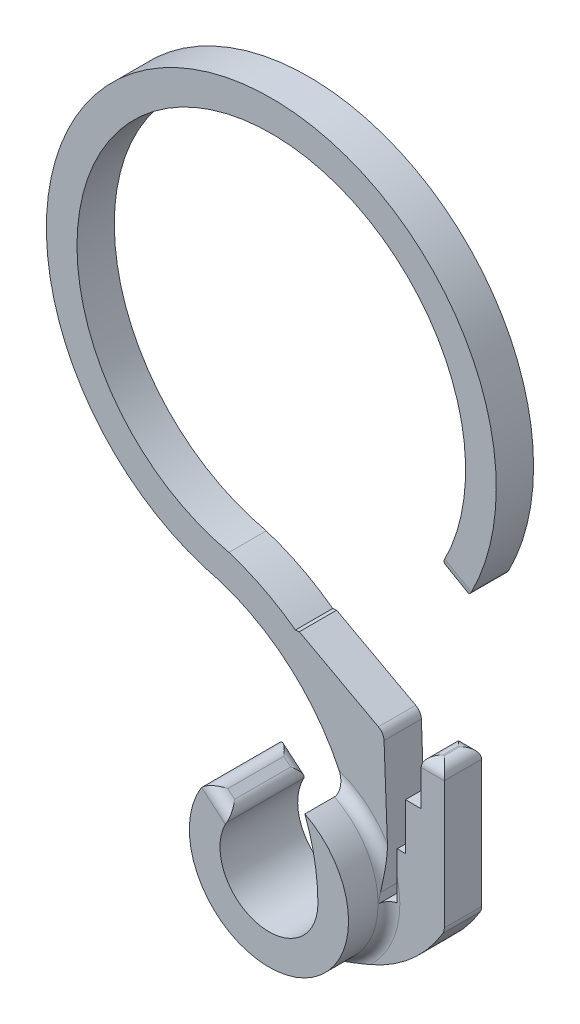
ISO-10303-21;
HEADER;
FILE_DESCRIPTION(('STEP AP214'),'2;1');
FILE_NAME('part.step','',(''),(''),'','','');
FILE_SCHEMA(('AUTOMOTIVE_DESIGN { 1 0 10303 214 1 1 1 1 }'));
ENDSEC;
DATA;
#1=APPLICATION_CONTEXT('core data for automotive mechanical design processes');
#2=APPLICATION_PROTOCOL_DEFINITION('international standard','automotive_design',2000,#1);
#3=PRODUCT_CONTEXT('',#1,'mechanical');
#4=PRODUCT('Part','Part','',(#3));
#5=PRODUCT_RELATED_PRODUCT_CATEGORY('part','',(#4));
#6=PRODUCT_DEFINITION_FORMATION('','',#4);
#7=PRODUCT_DEFINITION_CONTEXT('part definition',#1,'design');
#8=PRODUCT_DEFINITION('design','',#6,#7);
#9=PRODUCT_DEFINITION_SHAPE('','',#8);
#10=(LENGTH_UNIT() NAMED_UNIT(*) SI_UNIT(.MILLI.,.METRE.));
#11=(NAMED_UNIT(*) PLANE_ANGLE_UNIT() SI_UNIT($,.RADIAN.));
#12=(NAMED_UNIT(*) SI_UNIT($,.STERADIAN.) SOLID_ANGLE_UNIT());
#13=UNCERTAINTY_MEASURE_WITH_UNIT(LENGTH_MEASURE(1.E-05),#10,'distance_accuracy_value','');
#14=(GEOMETRIC_REPRESENTATION_CONTEXT(3) GLOBAL_UNCERTAINTY_ASSIGNED_CONTEXT((#13)) GLOBAL_UNIT_ASSIGNED_CONTEXT((#10,
#11,#12)) REPRESENTATION_CONTEXT('',''));
#15=CARTESIAN_POINT('',(0.,0.,0.));
#16=DIRECTION('',(0.,0.,1.));
#17=DIRECTION('',(1.,0.,0.));
#18=AXIS2_PLACEMENT_3D('',#15,#16,#17);
#19=CARTESIAN_POINT('',(0.,0.,3.1));
#20=DIRECTION('',(0.,0.,1.));
#21=DIRECTION('',(1.,0.,0.));
#22=AXIS2_PLACEMENT_3D('',#19,#20,#21);
#23=TOROIDAL_SURFACE('',#22,5.82,0.7);
#24=CARTESIAN_POINT('',(5.82,0.,3.1));
#25=DIRECTION('',(0.,1.,0.));
#26=DIRECTION('',(-1.,0.,0.));
#27=AXIS2_PLACEMENT_3D('',#24,#25,#26);
#28=CIRCLE('',#27,0.7);
#29=CARTESIAN_POINT('',(5.12,0.,3.09999793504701));
#30=VERTEX_POINT('',#29);
#31=CARTESIAN_POINT('',(5.65,0.,2.4209565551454));
#32=VERTEX_POINT('',#31);
#33=EDGE_CURVE('E107',#30,#32,#28,.F.);
#34=ORIENTED_EDGE('',*,*,#33,.F.);
#35=CARTESIAN_POINT('',(0.,0.,3.1));
#36=DIRECTION('',(0.,0.,1.));
#37=DIRECTION('',(1.,0.,0.));
#38=AXIS2_PLACEMENT_3D('',#35,#36,#37);
#39=CIRCLE('',#38,5.12);
#40=CARTESIAN_POINT('',(0.,-5.12,3.1));
#41=VERTEX_POINT('',#40);
#42=EDGE_CURVE('E514',#41,#30,#39,.T.);
#43=ORIENTED_EDGE('',*,*,#42,.F.);
#44=CARTESIAN_POINT('',(3.88248314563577,-4.3357496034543,2.4));
#45=CARTESIAN_POINT('',(3.77393906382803,-4.3814716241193,2.400042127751));
#46=CARTESIAN_POINT('',(3.66462624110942,-4.42524937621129,2.4031480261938));
#47=CARTESIAN_POINT('',(3.44484362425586,-4.508808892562,2.41462716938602));
#48=CARTESIAN_POINT('',(3.33437475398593,-4.54859361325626,2.42299648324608));
#49=CARTESIAN_POINT('',(3.11268098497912,-4.6240656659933,2.4441274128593));
#50=CARTESIAN_POINT('',(3.00145763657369,-4.6597596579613,2.45688175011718));
#51=CARTESIAN_POINT('',(2.77826335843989,-4.72711763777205,2.48614227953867));
#52=CARTESIAN_POINT('',(2.6662922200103,-4.75878044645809,2.50264956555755));
#53=CARTESIAN_POINT('',(2.34495078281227,-4.84364442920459,2.55444875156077));
#54=CARTESIAN_POINT('',(2.13487113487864,-4.89186779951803,2.59366236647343));
#55=CARTESIAN_POINT('',(1.71363145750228,-4.97445557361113,2.67993887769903));
#56=CARTESIAN_POINT('',(1.50247098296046,-5.00881370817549,2.72700531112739));
#57=CARTESIAN_POINT('',(0.868026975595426,-5.09138398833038,2.8758828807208));
#58=CARTESIAN_POINT('',(0.443595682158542,-5.11914035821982,2.98540697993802));
#59=CARTESIAN_POINT('',(0.0132213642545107,-5.1199934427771,3.09658450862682));
#60=CARTESIAN_POINT('',(0.00661059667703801,-5.11999999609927,3.09829228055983));
#61=CARTESIAN_POINT('',(0.,-5.12,3.1));
#62=B_SPLINE_CURVE_WITH_KNOTS('',3,(#44,#45,#46,#47,#48,#49,#50,#51,#52,#53,#54,#55,#56,#57,#58,
#59,#60,#61),.UNSPECIFIED.,.F.,.F.,(4,2,2,2,2,2,2,2,4),(0.,0.353218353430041,0.706173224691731,
1.05854504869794,1.41101970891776,2.06750890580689,2.72429460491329,4.03728688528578,
4.05777025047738),.UNSPECIFIED.);
#63=CARTESIAN_POINT('',(3.88248314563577,-4.3357496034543,2.4));
#64=VERTEX_POINT('',#63);
#65=EDGE_CURVE('E99',#64,#41,#62,.T.);
#66=ORIENTED_EDGE('',*,*,#65,.F.);
#67=CARTESIAN_POINT('',(0.,0.,2.4));
#68=DIRECTION('',(0.,0.,1.));
#69=DIRECTION('',(1.,0.,0.));
#70=AXIS2_PLACEMENT_3D('',#67,#68,#69);
#71=CIRCLE('',#70,5.82);
#72=CARTESIAN_POINT('',(5.65,1.39638819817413,2.4));
#73=VERTEX_POINT('',#72);
#74=EDGE_CURVE('E527',#73,#64,#71,.F.);
#75=ORIENTED_EDGE('',*,*,#74,.F.);
#76=CARTESIAN_POINT('',(5.65,0.,2.4209565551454));
#77=CARTESIAN_POINT('',(5.65,0.0581933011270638,2.42096290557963));
#78=CARTESIAN_POINT('',(5.65,0.116386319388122,2.42073077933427));
#79=CARTESIAN_POINT('',(5.65,0.232767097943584,2.41984357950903));
#80=CARTESIAN_POINT('',(5.65,0.290954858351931,2.41918852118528));
#81=CARTESIAN_POINT('',(5.65,0.465509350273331,2.41666992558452));
#82=CARTESIAN_POINT('',(5.65,0.58186745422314,2.41425296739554));
#83=CARTESIAN_POINT('',(5.65,0.814567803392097,2.40898907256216));
#84=CARTESIAN_POINT('',(5.65,0.930910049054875,2.40614215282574));
#85=CARTESIAN_POINT('',(5.65,1.10544473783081,2.40277443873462));
#86=CARTESIAN_POINT('',(5.65,1.16362709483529,2.40180230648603));
#87=CARTESIAN_POINT('',(5.65,1.28000140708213,2.40041717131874));
#88=CARTESIAN_POINT('',(5.65,1.33819336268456,2.4000042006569));
#89=CARTESIAN_POINT('',(5.65,1.39638819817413,2.4));
#90=B_SPLINE_CURVE_WITH_KNOTS('',3,(#76,#77,#78,#79,#80,#81,#82,#83,#84,#85,#86,#87,#88,#89),
.UNSPECIFIED.,.F.,.F.,(4,2,2,2,2,2,4),(0.,0.174579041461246,0.349151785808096,0.698296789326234,
1.04742806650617,1.22199714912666,1.3965763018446),.UNSPECIFIED.);
#91=EDGE_CURVE('E739',#32,#73,#90,.T.);
#92=ORIENTED_EDGE('',*,*,#91,.F.);
#93=EDGE_LOOP('',(#34,#43,#66,#75,#92));
#94=FACE_BOUND('',#93,.T.);
#95=ADVANCED_FACE('F89',(#94),#23,.F.);
#96=CARTESIAN_POINT('',(-9.68336484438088,0.,2.4));
#97=DIRECTION('',(0.,0.,-1.));
#98=DIRECTION('',(-1.,0.,0.));
#99=AXIS2_PLACEMENT_3D('',#96,#97,#98);
#100=CYLINDRICAL_SURFACE('',#99,14.8033648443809);
#101=DIRECTION('',(0.,0.,-1.));
#102=VECTOR('',#101,1.);
#103=CARTESIAN_POINT('',(5.10941087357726,0.559818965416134,2.4));
#104=LINE('',#103,#102);
#105=CARTESIAN_POINT('',(5.10941087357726,0.559818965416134,2.93391660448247));
#106=VERTEX_POINT('',#105);
#107=CARTESIAN_POINT('',(5.10941087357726,0.559818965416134,0.));
#108=VERTEX_POINT('',#107);
#109=EDGE_CURVE('E114',#106,#108,#104,.T.);
#110=ORIENTED_EDGE('',*,*,#109,.F.);
#111=CARTESIAN_POINT('',(5.10941087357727,0.559818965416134,2.93391660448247));
#112=CARTESIAN_POINT('',(5.11625655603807,0.378776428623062,2.98718383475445));
#113=CARTESIAN_POINT('',(5.1197830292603,0.197820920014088,3.04085509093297));
#114=CARTESIAN_POINT('',(5.11999676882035,0.0113015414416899,3.09661985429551));
#115=CARTESIAN_POINT('',(5.12000000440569,0.00565072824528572,3.09830972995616));
#116=CARTESIAN_POINT('',(5.11999999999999,0.,3.1));
#117=B_SPLINE_CURVE_WITH_KNOTS('',3,(#111,#112,#113,#114,#115,#116),.UNSPECIFIED.,.F.,.F.,(4,2,
4),(0.,0.566340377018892,0.584034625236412),.UNSPECIFIED.);
#118=EDGE_CURVE('E712',#106,#30,#117,.T.);
#119=ORIENTED_EDGE('',*,*,#118,.T.);
#120=DIRECTION('',(0.,0.,-1.));
#121=VECTOR('',#120,1.);
#122=CARTESIAN_POINT('',(5.12,0.,2.4));
#123=LINE('',#122,#121);
#124=CARTESIAN_POINT('',(5.12,0.,0.));
#125=VERTEX_POINT('',#124);
#126=EDGE_CURVE('E465',#30,#125,#123,.T.);
#127=ORIENTED_EDGE('',*,*,#126,.T.);
#128=CARTESIAN_POINT('',(-9.68336484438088,0.,0.));
#129=DIRECTION('',(0.,0.,1.));
#130=DIRECTION('',(1.,0.,0.));
#131=AXIS2_PLACEMENT_3D('',#128,#129,#130);
#132=CIRCLE('',#131,14.8033648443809);
#133=EDGE_CURVE('E466',#125,#108,#132,.T.);
#134=ORIENTED_EDGE('',*,*,#133,.T.);
#135=EDGE_LOOP('',(#110,#119,#127,#134));
#136=FACE_BOUND('',#135,.T.);
#137=ADVANCED_FACE('F774',(#136),#100,.T.);
#138=CARTESIAN_POINT('',(0.,0.,5.));
#139=DIRECTION('',(0.,0.,-1.));
#140=DIRECTION('',(-1.,0.,0.));
#141=AXIS2_PLACEMENT_3D('',#138,#139,#140);
#142=CYLINDRICAL_SURFACE('',#141,5.12);
#143=CARTESIAN_POINT('',(0.,0.,5.));
#144=DIRECTION('',(0.,0.,1.));
#145=DIRECTION('',(1.,0.,0.));
#146=AXIS2_PLACEMENT_3D('',#143,#144,#145);
#147=CIRCLE('',#146,5.12);
#148=CARTESIAN_POINT('',(-4.39385934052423,2.62838355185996,5.));
#149=VERTEX_POINT('',#148);
#150=CARTESIAN_POINT('',(2.3087686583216,4.56990013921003,5.));
#151=VERTEX_POINT('',#150);
#152=EDGE_CURVE('E494',#149,#151,#147,.T.);
#153=ORIENTED_EDGE('',*,*,#152,.F.);
#154=DIRECTION('',(0.,0.,-1.));
#155=VECTOR('',#154,1.);
#156=CARTESIAN_POINT('',(-4.39385934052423,2.62838355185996,5.));
#157=LINE('',#156,#155);
#158=CARTESIAN_POINT('',(-4.39385934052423,2.62838355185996,0.));
#159=VERTEX_POINT('',#158);
#160=EDGE_CURVE('E518',#149,#159,#157,.T.);
#161=ORIENTED_EDGE('',*,*,#160,.T.);
#162=CARTESIAN_POINT('',(0.,0.,0.));
#163=DIRECTION('',(0.,0.,1.));
#164=DIRECTION('',(1.,0.,0.));
#165=AXIS2_PLACEMENT_3D('',#162,#163,#164);
#166=CIRCLE('',#165,5.12);
#167=CARTESIAN_POINT('',(0.,-5.12,0.));
#168=VERTEX_POINT('',#167);
#169=EDGE_CURVE('E491',#159,#168,#166,.T.);
#170=ORIENTED_EDGE('',*,*,#169,.T.);
#171=DIRECTION('',(0.,0.,-1.));
#172=VECTOR('',#171,1.);
#173=CARTESIAN_POINT('',(0.,-5.12,2.4));
#174=LINE('',#173,#172);
#175=EDGE_CURVE('E402',#41,#168,#174,.T.);
#176=ORIENTED_EDGE('',*,*,#175,.F.);
#177=ORIENTED_EDGE('',*,*,#42,.T.);
#178=CARTESIAN_POINT('',(2.3087686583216,4.56990013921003,3.1));
#179=VERTEX_POINT('',#178);
#180=EDGE_CURVE('E515',#30,#179,#39,.T.);
#181=ORIENTED_EDGE('',*,*,#180,.T.);
#182=DIRECTION('',(0.,0.,-1.));
#183=VECTOR('',#182,1.);
#184=CARTESIAN_POINT('',(2.3087686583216,4.56990013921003,5.));
#185=LINE('',#184,#183);
#186=EDGE_CURVE('E497',#151,#179,#185,.T.);
#187=ORIENTED_EDGE('',*,*,#186,.F.);
#188=EDGE_LOOP('',(#153,#161,#170,#176,#177,#181,#187));
#189=FACE_BOUND('',#188,.T.);
#190=ADVANCED_FACE('F779',(#189),#142,.T.);
#191=CARTESIAN_POINT('',(-9.68336484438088,0.,5.));
#192=DIRECTION('',(0.,0.,-1.));
#193=DIRECTION('',(-1.,0.,0.));
#194=AXIS2_PLACEMENT_3D('',#191,#192,#193);
#195=CYLINDRICAL_SURFACE('',#194,12.8333648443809);
#196=CARTESIAN_POINT('',(-9.68336484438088,0.,0.));
#197=DIRECTION('',(0.,0.,1.));
#198=DIRECTION('',(1.,0.,0.));
#199=AXIS2_PLACEMENT_3D('',#196,#197,#198);
#200=CIRCLE('',#199,12.8333648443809);
#201=CARTESIAN_POINT('',(3.15,0.,0.));
#202=VERTEX_POINT('',#201);
#203=CARTESIAN_POINT('',(-5.69670154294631,12.19843305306,0.));
#204=VERTEX_POINT('',#203);
#205=EDGE_CURVE('E485',#202,#204,#200,.T.);
#206=ORIENTED_EDGE('',*,*,#205,.F.);
#207=DIRECTION('',(0.,0.,-1.));
#208=VECTOR('',#207,1.);
#209=CARTESIAN_POINT('',(3.15,0.,5.));
#210=LINE('',#209,#208);
#211=CARTESIAN_POINT('',(3.15,0.,5.));
#212=VERTEX_POINT('',#211);
#213=EDGE_CURVE('E510',#212,#202,#210,.T.);
#214=ORIENTED_EDGE('',*,*,#213,.F.);
#215=CARTESIAN_POINT('',(-9.68336484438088,0.,5.));
#216=DIRECTION('',(0.,0.,1.));
#217=DIRECTION('',(1.,0.,0.));
#218=AXIS2_PLACEMENT_3D('',#215,#216,#217);
#219=CIRCLE('',#218,12.8333648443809);
#220=EDGE_CURVE('E486',#212,#151,#219,.T.);
#221=ORIENTED_EDGE('',*,*,#220,.T.);
#222=ORIENTED_EDGE('',*,*,#186,.T.);
#223=CARTESIAN_POINT('',(2.3087686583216,4.56990013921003,3.1));
#224=CARTESIAN_POINT('',(2.30876978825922,4.56989655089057,3.08462641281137));
#225=CARTESIAN_POINT('',(2.30850064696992,4.57060349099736,3.06926297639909));
#226=CARTESIAN_POINT('',(2.30743494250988,4.57339886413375,3.03869538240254));
#227=CARTESIAN_POINT('',(2.30663889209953,4.57548595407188,3.02349108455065));
#228=CARTESIAN_POINT('',(2.30350172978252,4.58370137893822,2.97860215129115));
#229=CARTESIAN_POINT('',(2.3004109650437,4.5917857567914,2.94930796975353));
#230=CARTESIAN_POINT('',(2.29247181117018,4.61245149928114,2.89278139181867));
#231=CARTESIAN_POINT('',(2.28762964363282,4.62501694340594,2.86554210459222));
#232=CARTESIAN_POINT('',(2.27645784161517,4.65383009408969,2.81335747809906));
#233=CARTESIAN_POINT('',(2.27012423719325,4.6700876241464,2.78841851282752));
#234=CARTESIAN_POINT('',(2.25298766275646,4.71375786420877,2.7299894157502));
#235=CARTESIAN_POINT('',(2.24147940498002,4.74283273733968,2.69795108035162));
#236=CARTESIAN_POINT('',(2.2164820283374,4.80520925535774,2.63923145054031));
#237=CARTESIAN_POINT('',(2.20298899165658,4.83851924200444,2.61256100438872));
#238=CARTESIAN_POINT('',(2.16856574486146,4.92237706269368,2.5542858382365));
#239=CARTESIAN_POINT('',(2.14686730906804,4.9743573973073,2.52520085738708));
#240=CARTESIAN_POINT('',(2.10120811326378,5.08158575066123,2.47628917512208));
#241=CARTESIAN_POINT('',(2.07724328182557,5.13683958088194,2.45647953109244));
#242=CARTESIAN_POINT('',(2.03030126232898,5.24292479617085,2.42729658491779));
#243=CARTESIAN_POINT('',(2.00749614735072,5.29359073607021,2.41702837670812));
#244=CARTESIAN_POINT('',(1.96101889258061,5.39506520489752,2.40341895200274));
#245=CARTESIAN_POINT('',(1.93735311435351,5.44587082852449,2.40003453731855));
#246=CARTESIAN_POINT('',(1.91334825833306,5.49649874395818,2.4));
#247=B_SPLINE_CURVE_WITH_KNOTS('',3,(#223,#224,#225,#226,#227,#228,#229,#230,#231,#232,#233,
#234,#235,#236,#237,#238,#239,#240,#241,#242,#243,#244,#245,#246),.UNSPECIFIED.,.F.,.F.,(4,2,2,
2,2,2,2,2,2,2,2,4),(0.,0.0460831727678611,0.0921215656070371,0.183214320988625,
0.273986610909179,0.365003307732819,0.498563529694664,0.6323910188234,0.821555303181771,
1.01106610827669,1.18014540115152,1.34816034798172),.UNSPECIFIED.);
#248=CARTESIAN_POINT('',(1.91334825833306,5.49649874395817,2.4));
#249=VERTEX_POINT('',#248);
#250=EDGE_CURVE('E12',#179,#249,#247,.T.);
#251=ORIENTED_EDGE('',*,*,#250,.T.);
#252=CARTESIAN_POINT('',(-9.68336484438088,0.,2.4));
#253=DIRECTION('',(0.,0.,1.));
#254=DIRECTION('',(1.,0.,0.));
#255=AXIS2_PLACEMENT_3D('',#252,#253,#254);
#256=CIRCLE('',#255,12.8333648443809);
#257=CARTESIAN_POINT('',(-5.69670154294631,12.19843305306,2.4));
#258=VERTEX_POINT('',#257);
#259=EDGE_CURVE('E462',#249,#258,#256,.T.);
#260=ORIENTED_EDGE('',*,*,#259,.T.);
#261=DIRECTION('',(0.,0.,-1.));
#262=VECTOR('',#261,1.);
#263=CARTESIAN_POINT('',(-5.69670154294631,12.19843305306,2.4));
#264=LINE('',#263,#262);
#265=EDGE_CURVE('E477',#258,#204,#264,.T.);
#266=ORIENTED_EDGE('',*,*,#265,.T.);
#267=EDGE_LOOP('',(#206,#214,#221,#222,#251,#260,#266));
#268=FACE_BOUND('',#267,.T.);
#269=ADVANCED_FACE('F726',(#268),#195,.F.);
#270=CARTESIAN_POINT('',(0.,0.,5.));
#271=DIRECTION('',(0.,0.,-1.));
#272=DIRECTION('',(-1.,0.,0.));
#273=AXIS2_PLACEMENT_3D('',#270,#271,#272);
#274=CYLINDRICAL_SURFACE('',#273,3.15);
#275=DIRECTION('',(0.,0.,-1.));
#276=VECTOR('',#275,1.);
#277=CARTESIAN_POINT('',(-2.74096184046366,1.55229771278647,5.));
#278=LINE('',#277,#276);
#279=CARTESIAN_POINT('',(-2.74096184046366,1.55229771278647,0.0116674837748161));
#280=VERTEX_POINT('',#279);
#281=CARTESIAN_POINT('',(-2.74096184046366,1.55229771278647,4.98833251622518));
#282=VERTEX_POINT('',#281);
#283=EDGE_CURVE('E662',#280,#282,#278,.F.);
#284=ORIENTED_EDGE('',*,*,#283,.T.);
#285=CARTESIAN_POINT('',(-2.74096184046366,1.55229771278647,4.98833251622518));
#286=CARTESIAN_POINT('',(-2.75155432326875,1.53360130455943,4.99222646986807));
#287=CARTESIAN_POINT('',(-2.76199172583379,1.51472181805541,4.99514573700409));
#288=CARTESIAN_POINT('',(-2.78255637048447,1.47659668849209,4.9990348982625));
#289=CARTESIAN_POINT('',(-2.79268361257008,1.45735104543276,5.00000479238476));
#290=CARTESIAN_POINT('',(-2.80265577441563,1.43792232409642,5.00000000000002));
#291=B_SPLINE_CURVE_WITH_KNOTS('',3,(#285,#286,#287,#288,#289,#290),.UNSPECIFIED.,.F.,.F.,(4,2,
4),(0.,0.0653074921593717,0.13061498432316),.UNSPECIFIED.);
#292=CARTESIAN_POINT('',(-2.80265577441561,1.43792232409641,5.));
#293=VERTEX_POINT('',#292);
#294=EDGE_CURVE('E682',#282,#293,#291,.T.);
#295=ORIENTED_EDGE('',*,*,#294,.T.);
#296=CARTESIAN_POINT('',(0.,0.,5.));
#297=DIRECTION('',(0.,0.,1.));
#298=DIRECTION('',(1.,0.,0.));
#299=AXIS2_PLACEMENT_3D('',#296,#297,#298);
#300=CIRCLE('',#299,3.15);
#301=EDGE_CURVE('E490',#293,#212,#300,.T.);
#302=ORIENTED_EDGE('',*,*,#301,.T.);
#303=ORIENTED_EDGE('',*,*,#213,.T.);
#304=CARTESIAN_POINT('',(0.,0.,0.));
#305=DIRECTION('',(0.,0.,1.));
#306=DIRECTION('',(1.,0.,0.));
#307=AXIS2_PLACEMENT_3D('',#304,#305,#306);
#308=CIRCLE('',#307,3.15);
#309=CARTESIAN_POINT('',(-2.80265577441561,1.43792232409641,0.));
#310=VERTEX_POINT('',#309);
#311=EDGE_CURVE('E501',#310,#202,#308,.T.);
#312=ORIENTED_EDGE('',*,*,#311,.F.);
#313=CARTESIAN_POINT('',(-2.80265577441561,1.43792232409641,0.));
#314=CARTESIAN_POINT('',(-2.79268361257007,1.45735104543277,-4.79238479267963E-06));
#315=CARTESIAN_POINT('',(-2.78255637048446,1.4765966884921,0.000965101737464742));
#316=CARTESIAN_POINT('',(-2.76199172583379,1.51472181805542,0.00485426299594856));
#317=CARTESIAN_POINT('',(-2.75155432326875,1.53360130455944,0.00777353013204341));
#318=CARTESIAN_POINT('',(-2.74096184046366,1.55229771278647,0.0116674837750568));
#319=B_SPLINE_CURVE_WITH_KNOTS('',3,(#313,#314,#315,#316,#317,#318),.UNSPECIFIED.,.F.,.F.,(4,2,
4),(0.,0.0653074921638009,0.130614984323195),.UNSPECIFIED.);
#320=EDGE_CURVE('E653',#310,#280,#319,.T.);
#321=ORIENTED_EDGE('',*,*,#320,.T.);
#322=EDGE_LOOP('',(#284,#295,#302,#303,#312,#321));
#323=FACE_BOUND('',#322,.T.);
#324=ADVANCED_FACE('F664',(#323),#274,.F.);
#325=CARTESIAN_POINT('',(0.,0.,5.));
#326=DIRECTION('',(-0.642787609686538,-0.766044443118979,0.));
#327=DIRECTION('',(0.766044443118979,-0.642787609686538,0.));
#328=AXIS2_PLACEMENT_3D('',#325,#326,#327);
#329=PLANE('',#328);
#330=DIRECTION('',(-0.766044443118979,0.642787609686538,0.));
#331=VECTOR('',#330,1.);
#332=CARTESIAN_POINT('',(-2.41303999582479,2.02478097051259,4.3));
#333=LINE('',#332,#331);
#334=CARTESIAN_POINT('',(-3.34318505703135,2.80526534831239,4.3));
#335=VERTEX_POINT('',#334);
#336=CARTESIAN_POINT('',(-2.90011314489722,2.43348387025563,4.3));
#337=VERTEX_POINT('',#336);
#338=EDGE_CURVE('E646',#335,#337,#333,.F.);
#339=ORIENTED_EDGE('',*,*,#338,.T.);
#340=DIRECTION('',(0.,0.,1.));
#341=VECTOR('',#340,1.);
#342=CARTESIAN_POINT('',(-2.90011314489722,2.43348387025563,0.));
#343=LINE('',#342,#341);
#344=CARTESIAN_POINT('',(-2.90011314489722,2.43348387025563,0.7));
#345=VERTEX_POINT('',#344);
#346=EDGE_CURVE('E649',#337,#345,#343,.F.);
#347=ORIENTED_EDGE('',*,*,#346,.T.);
#348=DIRECTION('',(-0.766044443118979,0.642787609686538,0.));
#349=VECTOR('',#348,1.);
#350=CARTESIAN_POINT('',(0.,0.,0.7));
#351=LINE('',#350,#349);
#352=CARTESIAN_POINT('',(-3.34318505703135,2.80526534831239,0.7));
#353=VERTEX_POINT('',#352);
#354=EDGE_CURVE('E640',#345,#353,#351,.T.);
#355=ORIENTED_EDGE('',*,*,#354,.T.);
#356=DIRECTION('',(0.,0.,-1.));
#357=VECTOR('',#356,1.);
#358=CARTESIAN_POINT('',(-3.34318505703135,2.80526534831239,5.));
#359=LINE('',#358,#357);
#360=EDGE_CURVE('E643',#353,#335,#359,.F.);
#361=ORIENTED_EDGE('',*,*,#360,.T.);
#362=EDGE_LOOP('',(#339,#347,#355,#361));
#363=FACE_BOUND('',#362,.T.);
#364=ADVANCED_FACE('F877',(#363),#329,.F.);
#365=CARTESIAN_POINT('',(0.,0.,5.));
#366=DIRECTION('',(0.,0.,1.));
#367=DIRECTION('',(1.,0.,0.));
#368=AXIS2_PLACEMENT_3D('',#365,#366,#367);
#369=PLANE('',#368);
#370=ORIENTED_EDGE('',*,*,#301,.F.);
#371=DIRECTION('',(-0.766044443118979,0.642787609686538,0.));
#372=VECTOR('',#371,1.);
#373=CARTESIAN_POINT('',(-4.37209887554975,2.75484145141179,5.));
#374=LINE('',#373,#372);
#375=CARTESIAN_POINT('',(-4.32936749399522,2.71898556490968,5.));
#376=VERTEX_POINT('',#375);
#377=EDGE_CURVE('E692',#293,#376,#374,.T.);
#378=ORIENTED_EDGE('',*,*,#377,.T.);
#379=CARTESIAN_POINT('',(-3.79313638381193,2.26903423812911,5.));
#380=DIRECTION('',(0.,0.,1.));
#381=DIRECTION('',(1.,0.,0.));
#382=AXIS2_PLACEMENT_3D('',#379,#380,#381);
#383=CIRCLE('',#382,0.7);
#384=EDGE_CURVE('E689',#376,#149,#383,.T.);
#385=ORIENTED_EDGE('',*,*,#384,.T.);
#386=ORIENTED_EDGE('',*,*,#152,.T.);
#387=ORIENTED_EDGE('',*,*,#220,.F.);
#388=EDGE_LOOP('',(#370,#378,#385,#386,#387));
#389=FACE_BOUND('',#388,.T.);
#390=ADVANCED_FACE('F794',(#389),#369,.T.);
#391=CARTESIAN_POINT('',(0.,0.,0.));
#392=DIRECTION('',(0.,0.,1.));
#393=DIRECTION('',(1.,0.,0.));
#394=AXIS2_PLACEMENT_3D('',#391,#392,#393);
#395=PLANE('',#394);
#396=CARTESIAN_POINT('',(-2.4480910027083,26.2990511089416,0.));
#397=DIRECTION('',(0.,0.,1.));
#398=DIRECTION('',(1.,0.,0.));
#399=AXIS2_PLACEMENT_3D('',#396,#397,#398);
#400=CIRCLE('',#399,14.47);
#401=CARTESIAN_POINT('',(10.4348865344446,19.7104404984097,0.));
#402=VERTEX_POINT('',#401);
#403=EDGE_CURVE('E455',#402,#204,#400,.T.);
#404=ORIENTED_EDGE('',*,*,#403,.F.);
#405=CARTESIAN_POINT('',(9.81166025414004,20.0291707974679,0.));
#406=DIRECTION('',(0.,0.,1.));
#407=DIRECTION('',(1.,0.,0.));
#408=AXIS2_PLACEMENT_3D('',#405,#406,#407);
#409=CIRCLE('',#408,0.7);
#410=CARTESIAN_POINT('',(10.4178780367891,19.6791707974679,0.));
#411=VERTEX_POINT('',#410);
#412=EDGE_CURVE('E613',#402,#411,#409,.F.);
#413=ORIENTED_EDGE('',*,*,#412,.T.);
#414=DIRECTION('',(0.86602540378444,-0.499999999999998,0.));
#415=VECTOR('',#414,1.);
#416=CARTESIAN_POINT('',(11.1258004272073,19.2704516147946,0.));
#417=LINE('',#416,#415);
#418=CARTESIAN_POINT('',(8.71023911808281,20.6650765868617,0.));
#419=VERTEX_POINT('',#418);
#420=EDGE_CURVE('E610',#411,#419,#417,.F.);
#421=ORIENTED_EDGE('',*,*,#420,.T.);
#422=CARTESIAN_POINT('',(-2.4480910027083,26.2990511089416,0.));
#423=DIRECTION('',(0.,0.,1.));
#424=DIRECTION('',(1.,0.,0.));
#425=AXIS2_PLACEMENT_3D('',#422,#423,#424);
#426=CIRCLE('',#425,12.5);
#427=CARTESIAN_POINT('',(-5.17465818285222,14.1000416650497,0.));
#428=VERTEX_POINT('',#427);
#429=EDGE_CURVE('E469',#419,#428,#426,.T.);
#430=ORIENTED_EDGE('',*,*,#429,.T.);
#431=CARTESIAN_POINT('',(-0.895335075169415,11.9126043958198,0.));
#432=VERTEX_POINT('',#431);
#433=EDGE_CURVE('E450',#432,#428,#132,.T.);
#434=ORIENTED_EDGE('',*,*,#433,.F.);
#435=CARTESIAN_POINT('',(-2.4480910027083,26.2990511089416,0.));
#436=DIRECTION('',(0.,0.,1.));
#437=DIRECTION('',(1.,0.,0.));
#438=AXIS2_PLACEMENT_3D('',#435,#436,#437);
#439=CIRCLE('',#438,14.47);
#440=CARTESIAN_POINT('',(-0.646407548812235,11.9416545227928,0.));
#441=VERTEX_POINT('',#440);
#442=EDGE_CURVE('E362',#432,#441,#439,.T.);
#443=ORIENTED_EDGE('',*,*,#442,.T.);
#444=DIRECTION('',(-0.879499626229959,0.475899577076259,0.));
#445=VECTOR('',#444,1.);
#446=CARTESIAN_POINT('',(4.85182265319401,8.96654759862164,0.));
#447=LINE('',#446,#445);
#448=CARTESIAN_POINT('',(4.43873426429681,9.1900708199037,0.));
#449=VERTEX_POINT('',#448);
#450=EDGE_CURVE('E345',#449,#441,#447,.T.);
#451=ORIENTED_EDGE('',*,*,#450,.F.);
#452=CARTESIAN_POINT('',(4.10560456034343,8.57442108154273,0.));
#453=DIRECTION('',(0.,0.,1.));
#454=DIRECTION('',(1.,0.,0.));
#455=AXIS2_PLACEMENT_3D('',#452,#453,#454);
#456=CIRCLE('',#455,0.7);
#457=CARTESIAN_POINT('',(4.8051038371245,8.6008929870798,0.));
#458=VERTEX_POINT('',#457);
#459=EDGE_CURVE('E595',#449,#458,#456,.F.);
#460=ORIENTED_EDGE('',*,*,#459,.T.);
#461=DIRECTION('',(-0.037817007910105,0.99928468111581,0.));
#462=VECTOR('',#461,1.);
#463=CARTESIAN_POINT('',(5.12325930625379,0.193885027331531,0.));
#464=LINE('',#463,#462);
#465=EDGE_CURVE('E359',#108,#458,#464,.T.);
#466=ORIENTED_EDGE('',*,*,#465,.F.);
#467=ORIENTED_EDGE('',*,*,#133,.F.);
#468=DIRECTION('',(1.,0.,0.));
#469=VECTOR('',#468,1.);
#470=CARTESIAN_POINT('',(0.,0.,0.));
#471=LINE('',#470,#469);
#472=CARTESIAN_POINT('',(5.65,0.,0.));
#473=VERTEX_POINT('',#472);
#474=EDGE_CURVE('E379',#125,#473,#471,.T.);
#475=ORIENTED_EDGE('',*,*,#474,.T.);
#476=DIRECTION('',(0.,1.,0.));
#477=VECTOR('',#476,1.);
#478=CARTESIAN_POINT('',(5.65,0.,0.));
#479=LINE('',#478,#477);
#480=CARTESIAN_POINT('',(5.65,3.,0.));
#481=VERTEX_POINT('',#480);
#482=EDGE_CURVE('E425',#473,#481,#479,.T.);
#483=ORIENTED_EDGE('',*,*,#482,.T.);
#484=DIRECTION('',(1.,0.,0.));
#485=VECTOR('',#484,1.);
#486=CARTESIAN_POINT('',(0.,3.,0.));
#487=LINE('',#486,#485);
#488=CARTESIAN_POINT('',(6.18,3.,0.));
#489=VERTEX_POINT('',#488);
#490=EDGE_CURVE('E421',#481,#489,#487,.T.);
#491=ORIENTED_EDGE('',*,*,#490,.T.);
#492=DIRECTION('',(0.,1.,0.));
#493=VECTOR('',#492,1.);
#494=CARTESIAN_POINT('',(6.18,0.,0.));
#495=LINE('',#494,#493);
#496=CARTESIAN_POINT('',(6.18,6.,0.));
#497=VERTEX_POINT('',#496);
#498=EDGE_CURVE('E417',#489,#497,#495,.T.);
#499=ORIENTED_EDGE('',*,*,#498,.T.);
#500=DIRECTION('',(1.,0.,0.));
#501=VECTOR('',#500,1.);
#502=CARTESIAN_POINT('',(0.,6.,0.));
#503=LINE('',#502,#501);
#504=CARTESIAN_POINT('',(7.19,6.,0.));
#505=VERTEX_POINT('',#504);
#506=EDGE_CURVE('E413',#497,#505,#503,.T.);
#507=ORIENTED_EDGE('',*,*,#506,.T.);
#508=DIRECTION('',(0.,1.,0.));
#509=VECTOR('',#508,1.);
#510=CARTESIAN_POINT('',(7.19,0.,0.));
#511=LINE('',#510,#509);
#512=CARTESIAN_POINT('',(7.19,8.3,0.));
#513=VERTEX_POINT('',#512);
#514=EDGE_CURVE('E409',#505,#513,#511,.T.);
#515=ORIENTED_EDGE('',*,*,#514,.T.);
#516=DIRECTION('',(1.,0.,0.));
#517=VECTOR('',#516,1.);
#518=CARTESIAN_POINT('',(8.68,8.3,0.));
#519=LINE('',#518,#517);
#520=CARTESIAN_POINT('',(8.68,8.3,0.));
#521=VERTEX_POINT('',#520);
#522=EDGE_CURVE('E607',#513,#521,#519,.T.);
#523=ORIENTED_EDGE('',*,*,#522,.T.);
#524=DIRECTION('',(0.,-1.,0.));
#525=VECTOR('',#524,1.);
#526=CARTESIAN_POINT('',(8.68,0.,0.));
#527=LINE('',#526,#525);
#528=CARTESIAN_POINT('',(8.68,0.101817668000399,0.));
#529=VERTEX_POINT('',#528);
#530=EDGE_CURVE('E405',#521,#529,#527,.T.);
#531=ORIENTED_EDGE('',*,*,#530,.T.);
#532=CARTESIAN_POINT('',(7.98,0.101817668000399,0.));
#533=DIRECTION('',(0.,0.,1.));
#534=DIRECTION('',(1.,0.,0.));
#535=AXIS2_PLACEMENT_3D('',#532,#533,#534);
#536=CIRCLE('',#535,0.7);
#537=CARTESIAN_POINT('',(8.58049218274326,-0.257917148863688,0.));
#538=VERTEX_POINT('',#537);
#539=EDGE_CURVE('E598',#529,#538,#536,.F.);
#540=ORIENTED_EDGE('',*,*,#539,.T.);
#541=CARTESIAN_POINT('',(0.,4.88236922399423,0.));
#542=DIRECTION('',(0.,0.,1.));
#543=DIRECTION('',(1.,0.,0.));
#544=AXIS2_PLACEMENT_3D('',#541,#542,#543);
#545=CIRCLE('',#544,10.0023692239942);
#546=EDGE_CURVE('E373',#538,#168,#545,.F.);
#547=ORIENTED_EDGE('',*,*,#546,.T.);
#548=ORIENTED_EDGE('',*,*,#169,.F.);
#549=CARTESIAN_POINT('',(-3.79313638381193,2.26903423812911,0.));
#550=DIRECTION('',(0.,0.,1.));
#551=DIRECTION('',(1.,0.,0.));
#552=AXIS2_PLACEMENT_3D('',#549,#550,#551);
#553=CIRCLE('',#552,0.7);
#554=CARTESIAN_POINT('',(-4.32936749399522,2.71898556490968,0.));
#555=VERTEX_POINT('',#554);
#556=EDGE_CURVE('E604',#159,#555,#553,.F.);
#557=ORIENTED_EDGE('',*,*,#556,.T.);
#558=DIRECTION('',(-0.766044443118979,0.642787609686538,0.));
#559=VECTOR('',#558,1.);
#560=CARTESIAN_POINT('',(-0.449951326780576,-0.536231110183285,0.));
#561=LINE('',#560,#559);
#562=EDGE_CURVE('E601',#555,#310,#561,.F.);
#563=ORIENTED_EDGE('',*,*,#562,.T.);
#564=ORIENTED_EDGE('',*,*,#311,.T.);
#565=ORIENTED_EDGE('',*,*,#205,.T.);
#566=EDGE_LOOP('',(#404,#413,#421,#430,#434,#443,#451,#460,#466,#467,#475,#483,#491,#499,#507,
#515,#523,#531,#540,#547,#548,#557,#563,#564,#565));
#567=FACE_BOUND('',#566,.T.);
#568=ADVANCED_FACE('F788',(#567),#395,.F.);
#569=CARTESIAN_POINT('',(-9.68336484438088,0.,2.4));
#570=DIRECTION('',(0.,0.,1.));
#571=DIRECTION('',(1.,0.,0.));
#572=AXIS2_PLACEMENT_3D('',#569,#570,#571);
#573=CIRCLE('',#572,14.8033648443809);
#574=CARTESIAN_POINT('',(-0.895335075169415,11.9126043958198,2.4));
#575=VERTEX_POINT('',#574);
#576=CARTESIAN_POINT('',(-5.17465818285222,14.1000416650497,2.4));
#577=VERTEX_POINT('',#576);
#578=EDGE_CURVE('E451',#575,#577,#573,.T.);
#579=ORIENTED_EDGE('',*,*,#578,.F.);
#580=DIRECTION('',(0.,0.,-1.));
#581=VECTOR('',#580,1.);
#582=CARTESIAN_POINT('',(-0.895335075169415,11.9126043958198,2.4));
#583=LINE('',#582,#581);
#584=EDGE_CURVE('E352',#575,#432,#583,.T.);
#585=ORIENTED_EDGE('',*,*,#584,.T.);
#586=ORIENTED_EDGE('',*,*,#433,.T.);
#587=DIRECTION('',(0.,0.,-1.));
#588=VECTOR('',#587,1.);
#589=CARTESIAN_POINT('',(-5.17465818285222,14.1000416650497,2.4));
#590=LINE('',#589,#588);
#591=EDGE_CURVE('E481',#577,#428,#590,.T.);
#592=ORIENTED_EDGE('',*,*,#591,.F.);
#593=EDGE_LOOP('',(#579,#585,#586,#592));
#594=FACE_BOUND('',#593,.T.);
#595=ADVANCED_FACE('F771',(#594),#100,.T.);
#596=CARTESIAN_POINT('',(-2.4480910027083,26.2990511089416,2.4));
#597=DIRECTION('',(0.,0.,-1.));
#598=DIRECTION('',(-1.,0.,0.));
#599=AXIS2_PLACEMENT_3D('',#596,#597,#598);
#600=CYLINDRICAL_SURFACE('',#599,12.5);
#601=DIRECTION('',(0.,0.,-1.));
#602=VECTOR('',#601,1.);
#603=CARTESIAN_POINT('',(8.69343367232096,20.6319153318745,2.4));
#604=LINE('',#603,#602);
#605=CARTESIAN_POINT('',(8.69343367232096,20.6319153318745,0.000984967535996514));
#606=VERTEX_POINT('',#605);
#607=CARTESIAN_POINT('',(8.69343367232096,20.6319153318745,2.399015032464));
#608=VERTEX_POINT('',#607);
#609=EDGE_CURVE('E552',#606,#608,#604,.F.);
#610=ORIENTED_EDGE('',*,*,#609,.T.);
#611=CARTESIAN_POINT('',(8.69343367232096,20.6319153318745,2.399015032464));
#612=CARTESIAN_POINT('',(8.69624083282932,20.6374341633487,2.39934333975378));
#613=CARTESIAN_POINT('',(8.69904486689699,20.6429570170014,2.39958957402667));
#614=CARTESIAN_POINT('',(8.70464668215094,20.6540107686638,2.39991789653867));
#615=CARTESIAN_POINT('',(8.70744446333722,20.6595416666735,2.39999998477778));
#616=CARTESIAN_POINT('',(8.71023911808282,20.6650765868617,2.4));
#617=B_SPLINE_CURVE_WITH_KNOTS('',3,(#611,#612,#613,#614,#615,#616),.UNSPECIFIED.,.F.,.F.,(4,2,
4),(0.,0.0185964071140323,0.0371928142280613),.UNSPECIFIED.);
#618=CARTESIAN_POINT('',(8.71023911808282,20.6650765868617,2.4));
#619=VERTEX_POINT('',#618);
#620=EDGE_CURVE('E573',#608,#619,#617,.T.);
#621=ORIENTED_EDGE('',*,*,#620,.T.);
#622=CARTESIAN_POINT('',(-2.4480910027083,26.2990511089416,2.4));
#623=DIRECTION('',(0.,0.,1.));
#624=DIRECTION('',(1.,0.,0.));
#625=AXIS2_PLACEMENT_3D('',#622,#623,#624);
#626=CIRCLE('',#625,12.5);
#627=EDGE_CURVE('E454',#619,#577,#626,.T.);
#628=ORIENTED_EDGE('',*,*,#627,.T.);
#629=ORIENTED_EDGE('',*,*,#591,.T.);
#630=ORIENTED_EDGE('',*,*,#429,.F.);
#631=CARTESIAN_POINT('',(8.71023911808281,20.6650765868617,0.));
#632=CARTESIAN_POINT('',(8.70744446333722,20.6595416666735,1.52222192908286E-08));
#633=CARTESIAN_POINT('',(8.70464668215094,20.6540107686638,8.21034613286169E-05));
#634=CARTESIAN_POINT('',(8.69904486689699,20.6429570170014,0.000410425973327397));
#635=CARTESIAN_POINT('',(8.69624083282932,20.6374341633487,0.000656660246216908));
#636=CARTESIAN_POINT('',(8.69343367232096,20.6319153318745,0.00098496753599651));
#637=B_SPLINE_CURVE_WITH_KNOTS('',3,(#631,#632,#633,#634,#635,#636),.UNSPECIFIED.,.F.,.F.,(4,2,
4),(0.,0.0185964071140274,0.0371928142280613),.UNSPECIFIED.);
#638=EDGE_CURVE('E543',#419,#606,#637,.T.);
#639=ORIENTED_EDGE('',*,*,#638,.T.);
#640=EDGE_LOOP('',(#610,#621,#628,#629,#630,#639));
#641=FACE_BOUND('',#640,.T.);
#642=ADVANCED_FACE('F554',(#641),#600,.F.);
#643=CARTESIAN_POINT('',(10.7758004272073,18.6642338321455,2.4));
#644=DIRECTION('',(0.499999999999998,0.86602540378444,0.));
#645=DIRECTION('',(-0.86602540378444,0.499999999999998,0.));
#646=AXIS2_PLACEMENT_3D('',#643,#644,#645);
#647=PLANE('',#646);
#648=DIRECTION('',(0.86602540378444,-0.499999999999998,0.));
#649=VECTOR('',#648,1.);
#650=CARTESIAN_POINT('',(8.37722654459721,20.0490511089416,1.7));
#651=LINE('',#650,#649);
#652=CARTESIAN_POINT('',(9.46166025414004,19.4229530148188,1.7));
#653=VERTEX_POINT('',#652);
#654=CARTESIAN_POINT('',(8.96735905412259,19.7083379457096,1.7));
#655=VERTEX_POINT('',#654);
#656=EDGE_CURVE('E536',#653,#655,#651,.F.);
#657=ORIENTED_EDGE('',*,*,#656,.T.);
#658=DIRECTION('',(0.,0.,1.));
#659=VECTOR('',#658,1.);
#660=CARTESIAN_POINT('',(8.96735905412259,19.7083379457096,0.));
#661=LINE('',#660,#659);
#662=CARTESIAN_POINT('',(8.96735905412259,19.7083379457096,0.7));
#663=VERTEX_POINT('',#662);
#664=EDGE_CURVE('E539',#655,#663,#661,.F.);
#665=ORIENTED_EDGE('',*,*,#664,.T.);
#666=DIRECTION('',(0.86602540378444,-0.499999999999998,0.));
#667=VECTOR('',#666,1.);
#668=CARTESIAN_POINT('',(10.7758004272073,18.6642338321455,0.7));
#669=LINE('',#668,#667);
#670=CARTESIAN_POINT('',(9.46166025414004,19.4229530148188,0.7));
#671=VERTEX_POINT('',#670);
#672=EDGE_CURVE('E530',#663,#671,#669,.T.);
#673=ORIENTED_EDGE('',*,*,#672,.T.);
#674=DIRECTION('',(0.,0.,-1.));
#675=VECTOR('',#674,1.);
#676=CARTESIAN_POINT('',(9.46166025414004,19.4229530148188,2.4));
#677=LINE('',#676,#675);
#678=EDGE_CURVE('E533',#671,#653,#677,.F.);
#679=ORIENTED_EDGE('',*,*,#678,.T.);
#680=EDGE_LOOP('',(#657,#665,#673,#679));
#681=FACE_BOUND('',#680,.T.);
#682=ADVANCED_FACE('F764',(#681),#647,.F.);
#683=CARTESIAN_POINT('',(-2.4480910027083,26.2990511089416,2.4));
#684=DIRECTION('',(0.,0.,-1.));
#685=DIRECTION('',(-1.,0.,0.));
#686=AXIS2_PLACEMENT_3D('',#683,#684,#685);
#687=CYLINDRICAL_SURFACE('',#686,14.47);
#688=CARTESIAN_POINT('',(-2.4480910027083,26.2990511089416,2.4));
#689=DIRECTION('',(0.,0.,1.));
#690=DIRECTION('',(1.,0.,0.));
#691=AXIS2_PLACEMENT_3D('',#688,#689,#690);
#692=CIRCLE('',#691,14.47);
#693=CARTESIAN_POINT('',(10.4348865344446,19.7104404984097,2.4));
#694=VERTEX_POINT('',#693);
#695=EDGE_CURVE('E458',#694,#258,#692,.T.);
#696=ORIENTED_EDGE('',*,*,#695,.F.);
#697=DIRECTION('',(0.,0.,-1.));
#698=VECTOR('',#697,1.);
#699=CARTESIAN_POINT('',(10.4348865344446,19.7104404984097,2.4));
#700=LINE('',#699,#698);
#701=EDGE_CURVE('E592',#694,#402,#700,.T.);
#702=ORIENTED_EDGE('',*,*,#701,.T.);
#703=ORIENTED_EDGE('',*,*,#403,.T.);
#704=ORIENTED_EDGE('',*,*,#265,.F.);
#705=EDGE_LOOP('',(#696,#702,#703,#704));
#706=FACE_BOUND('',#705,.T.);
#707=ADVANCED_FACE('F762',(#706),#687,.T.);
#708=CARTESIAN_POINT('',(0.,0.,2.4));
#709=DIRECTION('',(0.,0.,1.));
#710=DIRECTION('',(1.,0.,0.));
#711=AXIS2_PLACEMENT_3D('',#708,#709,#710);
#712=PLANE('',#711);
#713=ORIENTED_EDGE('',*,*,#627,.F.);
#714=DIRECTION('',(0.86602540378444,-0.499999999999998,0.));
#715=VECTOR('',#714,1.);
#716=CARTESIAN_POINT('',(10.4332965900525,19.6702688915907,2.4));
#717=LINE('',#716,#715);
#718=CARTESIAN_POINT('',(10.4178780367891,19.6791707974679,2.4));
#719=VERTEX_POINT('',#718);
#720=EDGE_CURVE('E589',#619,#719,#717,.T.);
#721=ORIENTED_EDGE('',*,*,#720,.T.);
#722=CARTESIAN_POINT('',(9.81166025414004,20.0291707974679,2.4));
#723=DIRECTION('',(0.,0.,1.));
#724=DIRECTION('',(1.,0.,0.));
#725=AXIS2_PLACEMENT_3D('',#722,#723,#724);
#726=CIRCLE('',#725,0.7);
#727=EDGE_CURVE('E586',#719,#694,#726,.T.);
#728=ORIENTED_EDGE('',*,*,#727,.T.);
#729=ORIENTED_EDGE('',*,*,#695,.T.);
#730=ORIENTED_EDGE('',*,*,#259,.F.);
#731=CARTESIAN_POINT('',(0.,0.,2.4));
#732=DIRECTION('',(0.,0.,1.));
#733=DIRECTION('',(1.,0.,0.));
#734=AXIS2_PLACEMENT_3D('',#731,#732,#733);
#735=CIRCLE('',#734,5.82);
#736=CARTESIAN_POINT('',(5.01909405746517,2.94636977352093,2.4));
#737=VERTEX_POINT('',#736);
#738=EDGE_CURVE('E580',#249,#737,#735,.F.);
#739=ORIENTED_EDGE('',*,*,#738,.T.);
#740=DIRECTION('',(-0.037817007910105,0.99928468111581,0.));
#741=VECTOR('',#740,1.);
#742=CARTESIAN_POINT('',(5.12325930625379,0.193885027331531,2.4));
#743=LINE('',#742,#741);
#744=CARTESIAN_POINT('',(4.8051038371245,8.6008929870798,2.4));
#745=VERTEX_POINT('',#744);
#746=EDGE_CURVE('E340',#737,#745,#743,.T.);
#747=ORIENTED_EDGE('',*,*,#746,.T.);
#748=CARTESIAN_POINT('',(4.10560456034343,8.57442108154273,2.4));
#749=DIRECTION('',(0.,0.,1.));
#750=DIRECTION('',(1.,0.,0.));
#751=AXIS2_PLACEMENT_3D('',#748,#749,#750);
#752=CIRCLE('',#751,0.7);
#753=CARTESIAN_POINT('',(4.43873426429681,9.1900708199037,2.4));
#754=VERTEX_POINT('',#753);
#755=EDGE_CURVE('E334',#745,#754,#752,.T.);
#756=ORIENTED_EDGE('',*,*,#755,.T.);
#757=DIRECTION('',(-0.879499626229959,0.475899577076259,0.));
#758=VECTOR('',#757,1.);
#759=CARTESIAN_POINT('',(4.85182265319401,8.96654759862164,2.4));
#760=LINE('',#759,#758);
#761=CARTESIAN_POINT('',(-0.646407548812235,11.9416545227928,2.4));
#762=VERTEX_POINT('',#761);
#763=EDGE_CURVE('E324',#754,#762,#760,.T.);
#764=ORIENTED_EDGE('',*,*,#763,.T.);
#765=CARTESIAN_POINT('',(-2.4480910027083,26.2990511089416,2.4));
#766=DIRECTION('',(0.,0.,1.));
#767=DIRECTION('',(1.,0.,0.));
#768=AXIS2_PLACEMENT_3D('',#765,#766,#767);
#769=CIRCLE('',#768,14.47);
#770=EDGE_CURVE('E330',#575,#762,#769,.T.);
#771=ORIENTED_EDGE('',*,*,#770,.F.);
#772=ORIENTED_EDGE('',*,*,#578,.T.);
#773=EDGE_LOOP('',(#713,#721,#728,#729,#730,#739,#747,#756,#764,#771,#772));
#774=FACE_BOUND('',#773,.T.);
#775=ADVANCED_FACE('F327',(#774),#712,.T.);
#776=CARTESIAN_POINT('',(0.,4.88236922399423,2.4));
#777=DIRECTION('',(0.,0.,-1.));
#778=DIRECTION('',(-1.,0.,0.));
#779=AXIS2_PLACEMENT_3D('',#776,#777,#778);
#780=CYLINDRICAL_SURFACE('',#779,10.0023692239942);
#781=ORIENTED_EDGE('',*,*,#546,.F.);
#782=DIRECTION('',(0.,0.,-1.));
#783=VECTOR('',#782,1.);
#784=CARTESIAN_POINT('',(8.58049218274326,-0.257917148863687,2.4));
#785=LINE('',#784,#783);
#786=CARTESIAN_POINT('',(8.58049218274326,-0.257917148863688,2.4));
#787=VERTEX_POINT('',#786);
#788=EDGE_CURVE('E695',#538,#787,#785,.F.);
#789=ORIENTED_EDGE('',*,*,#788,.T.);
#790=CARTESIAN_POINT('',(0.,4.88236922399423,2.4));
#791=DIRECTION('',(0.,0.,1.));
#792=DIRECTION('',(1.,0.,0.));
#793=AXIS2_PLACEMENT_3D('',#790,#791,#792);
#794=CIRCLE('',#793,10.0023692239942);
#795=EDGE_CURVE('E374',#787,#64,#794,.F.);
#796=ORIENTED_EDGE('',*,*,#795,.T.);
#797=ORIENTED_EDGE('',*,*,#65,.T.);
#798=ORIENTED_EDGE('',*,*,#175,.T.);
#799=EDGE_LOOP('',(#781,#789,#796,#797,#798));
#800=FACE_BOUND('',#799,.T.);
#801=ADVANCED_FACE('F752',(#800),#780,.T.);
#802=CARTESIAN_POINT('',(8.68,0.,2.4));
#803=DIRECTION('',(1.,0.,0.));
#804=DIRECTION('',(0.,0.,-1.));
#805=AXIS2_PLACEMENT_3D('',#802,#803,#804);
#806=PLANE('',#805);
#807=ORIENTED_EDGE('',*,*,#530,.F.);
#808=DIRECTION('',(0.,0.,-1.));
#809=VECTOR('',#808,1.);
#810=CARTESIAN_POINT('',(8.68,8.3,2.4));
#811=LINE('',#810,#809);
#812=CARTESIAN_POINT('',(8.68,8.3,2.4));
#813=VERTEX_POINT('',#812);
#814=EDGE_CURVE('E633',#521,#813,#811,.F.);
#815=ORIENTED_EDGE('',*,*,#814,.T.);
#816=DIRECTION('',(0.,-1.,0.));
#817=VECTOR('',#816,1.);
#818=CARTESIAN_POINT('',(8.68,0.,2.4));
#819=LINE('',#818,#817);
#820=CARTESIAN_POINT('',(8.68,0.101817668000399,2.4));
#821=VERTEX_POINT('',#820);
#822=EDGE_CURVE('E378',#813,#821,#819,.T.);
#823=ORIENTED_EDGE('',*,*,#822,.T.);
#824=DIRECTION('',(0.,0.,-1.));
#825=VECTOR('',#824,1.);
#826=CARTESIAN_POINT('',(8.68,0.101817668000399,2.4));
#827=LINE('',#826,#825);
#828=EDGE_CURVE('E629',#821,#529,#827,.T.);
#829=ORIENTED_EDGE('',*,*,#828,.T.);
#830=EDGE_LOOP('',(#807,#815,#823,#829));
#831=FACE_BOUND('',#830,.T.);
#832=ADVANCED_FACE('F757',(#831),#806,.T.);
#833=CARTESIAN_POINT('',(0.,9.,2.4));
#834=DIRECTION('',(0.,1.,0.));
#835=DIRECTION('',(0.,0.,1.));
#836=AXIS2_PLACEMENT_3D('',#833,#834,#835);
#837=PLANE('',#836);
#838=DIRECTION('',(1.,0.,0.));
#839=VECTOR('',#838,1.);
#840=CARTESIAN_POINT('',(0.,9.,1.7));
#841=LINE('',#840,#839);
#842=CARTESIAN_POINT('',(7.89,9.,1.7));
#843=VERTEX_POINT('',#842);
#844=CARTESIAN_POINT('',(7.98,9.,1.7));
#845=VERTEX_POINT('',#844);
#846=EDGE_CURVE('E622',#843,#845,#841,.T.);
#847=ORIENTED_EDGE('',*,*,#846,.T.);
#848=DIRECTION('',(0.,0.,-1.));
#849=VECTOR('',#848,1.);
#850=CARTESIAN_POINT('',(7.98,9.,2.4));
#851=LINE('',#850,#849);
#852=CARTESIAN_POINT('',(7.98,9.,0.7));
#853=VERTEX_POINT('',#852);
#854=EDGE_CURVE('E625',#845,#853,#851,.T.);
#855=ORIENTED_EDGE('',*,*,#854,.T.);
#856=DIRECTION('',(1.,0.,0.));
#857=VECTOR('',#856,1.);
#858=CARTESIAN_POINT('',(7.19,9.,0.7));
#859=LINE('',#858,#857);
#860=CARTESIAN_POINT('',(7.89,9.,0.7));
#861=VERTEX_POINT('',#860);
#862=EDGE_CURVE('E616',#853,#861,#859,.F.);
#863=ORIENTED_EDGE('',*,*,#862,.T.);
#864=DIRECTION('',(0.,0.,-1.));
#865=VECTOR('',#864,1.);
#866=CARTESIAN_POINT('',(7.89,9.,2.4));
#867=LINE('',#866,#865);
#868=EDGE_CURVE('E619',#861,#843,#867,.F.);
#869=ORIENTED_EDGE('',*,*,#868,.T.);
#870=EDGE_LOOP('',(#847,#855,#863,#869));
#871=FACE_BOUND('',#870,.T.);
#872=ADVANCED_FACE('F953',(#871),#837,.T.);
#873=CARTESIAN_POINT('',(7.19,0.,2.4));
#874=DIRECTION('',(-1.,0.,0.));
#875=DIRECTION('',(0.,0.,1.));
#876=AXIS2_PLACEMENT_3D('',#873,#874,#875);
#877=PLANE('',#876);
#878=DIRECTION('',(0.,1.,0.));
#879=VECTOR('',#878,1.);
#880=CARTESIAN_POINT('',(7.19,0.,2.4));
#881=LINE('',#880,#879);
#882=CARTESIAN_POINT('',(7.19,6.,2.4));
#883=VERTEX_POINT('',#882);
#884=CARTESIAN_POINT('',(7.19,8.3,2.4));
#885=VERTEX_POINT('',#884);
#886=EDGE_CURVE('E383',#883,#885,#881,.T.);
#887=ORIENTED_EDGE('',*,*,#886,.T.);
#888=DIRECTION('',(0.,0.,-1.));
#889=VECTOR('',#888,1.);
#890=CARTESIAN_POINT('',(7.19,8.3,2.4));
#891=LINE('',#890,#889);
#892=EDGE_CURVE('E637',#885,#513,#891,.T.);
#893=ORIENTED_EDGE('',*,*,#892,.T.);
#894=ORIENTED_EDGE('',*,*,#514,.F.);
#895=DIRECTION('',(0.,0.,-1.));
#896=VECTOR('',#895,1.);
#897=CARTESIAN_POINT('',(7.19,6.,2.4));
#898=LINE('',#897,#896);
#899=EDGE_CURVE('E447',#883,#505,#898,.T.);
#900=ORIENTED_EDGE('',*,*,#899,.F.);
#901=EDGE_LOOP('',(#887,#893,#894,#900));
#902=FACE_BOUND('',#901,.T.);
#903=ADVANCED_FACE('F945',(#902),#877,.T.);
#904=CARTESIAN_POINT('',(0.,6.,2.4));
#905=DIRECTION('',(0.,1.,0.));
#906=DIRECTION('',(0.,0.,1.));
#907=AXIS2_PLACEMENT_3D('',#904,#905,#906);
#908=PLANE('',#907);
#909=ORIENTED_EDGE('',*,*,#506,.F.);
#910=DIRECTION('',(0.,0.,-1.));
#911=VECTOR('',#910,1.);
#912=CARTESIAN_POINT('',(6.18,6.,2.4));
#913=LINE('',#912,#911);
#914=CARTESIAN_POINT('',(6.18,6.,2.4));
#915=VERTEX_POINT('',#914);
#916=EDGE_CURVE('E444',#915,#497,#913,.T.);
#917=ORIENTED_EDGE('',*,*,#916,.F.);
#918=DIRECTION('',(1.,0.,0.));
#919=VECTOR('',#918,1.);
#920=CARTESIAN_POINT('',(0.,6.,2.4));
#921=LINE('',#920,#919);
#922=EDGE_CURVE('E387',#915,#883,#921,.T.);
#923=ORIENTED_EDGE('',*,*,#922,.T.);
#924=ORIENTED_EDGE('',*,*,#899,.T.);
#925=EDGE_LOOP('',(#909,#917,#923,#924));
#926=FACE_BOUND('',#925,.T.);
#927=ADVANCED_FACE('F959',(#926),#908,.T.);
#928=CARTESIAN_POINT('',(6.18,0.,2.4));
#929=DIRECTION('',(-1.,0.,0.));
#930=DIRECTION('',(0.,0.,1.));
#931=AXIS2_PLACEMENT_3D('',#928,#929,#930);
#932=PLANE('',#931);
#933=ORIENTED_EDGE('',*,*,#498,.F.);
#934=DIRECTION('',(0.,0.,-1.));
#935=VECTOR('',#934,1.);
#936=CARTESIAN_POINT('',(6.18,3.,2.4));
#937=LINE('',#936,#935);
#938=CARTESIAN_POINT('',(6.18,3.,2.4));
#939=VERTEX_POINT('',#938);
#940=EDGE_CURVE('E441',#939,#489,#937,.T.);
#941=ORIENTED_EDGE('',*,*,#940,.F.);
#942=DIRECTION('',(0.,1.,0.));
#943=VECTOR('',#942,1.);
#944=CARTESIAN_POINT('',(6.18,0.,2.4));
#945=LINE('',#944,#943);
#946=EDGE_CURVE('E391',#939,#915,#945,.T.);
#947=ORIENTED_EDGE('',*,*,#946,.T.);
#948=ORIENTED_EDGE('',*,*,#916,.T.);
#949=EDGE_LOOP('',(#933,#941,#947,#948));
#950=FACE_BOUND('',#949,.T.);
#951=ADVANCED_FACE('F963',(#950),#932,.T.);
#952=CARTESIAN_POINT('',(0.,3.,2.4));
#953=DIRECTION('',(0.,1.,0.));
#954=DIRECTION('',(0.,0.,1.));
#955=AXIS2_PLACEMENT_3D('',#952,#953,#954);
#956=PLANE('',#955);
#957=ORIENTED_EDGE('',*,*,#490,.F.);
#958=DIRECTION('',(0.,0.,-1.));
#959=VECTOR('',#958,1.);
#960=CARTESIAN_POINT('',(5.65,3.,2.4));
#961=LINE('',#960,#959);
#962=CARTESIAN_POINT('',(5.65,3.,2.4));
#963=VERTEX_POINT('',#962);
#964=EDGE_CURVE('E438',#963,#481,#961,.T.);
#965=ORIENTED_EDGE('',*,*,#964,.F.);
#966=DIRECTION('',(1.,0.,0.));
#967=VECTOR('',#966,1.);
#968=CARTESIAN_POINT('',(0.,3.,2.4));
#969=LINE('',#968,#967);
#970=EDGE_CURVE('E395',#963,#939,#969,.T.);
#971=ORIENTED_EDGE('',*,*,#970,.T.);
#972=ORIENTED_EDGE('',*,*,#940,.T.);
#973=EDGE_LOOP('',(#957,#965,#971,#972));
#974=FACE_BOUND('',#973,.T.);
#975=ADVANCED_FACE('F967',(#974),#956,.T.);
#976=CARTESIAN_POINT('',(5.65,0.,2.4));
#977=DIRECTION('',(-1.,0.,0.));
#978=DIRECTION('',(0.,0.,1.));
#979=AXIS2_PLACEMENT_3D('',#976,#977,#978);
#980=PLANE('',#979);
#981=ORIENTED_EDGE('',*,*,#482,.F.);
#982=DIRECTION('',(0.,0.,-1.));
#983=VECTOR('',#982,1.);
#984=CARTESIAN_POINT('',(5.65,0.,2.4));
#985=LINE('',#984,#983);
#986=EDGE_CURVE('E435',#32,#473,#985,.T.);
#987=ORIENTED_EDGE('',*,*,#986,.F.);
#988=ORIENTED_EDGE('',*,*,#91,.T.);
#989=DIRECTION('',(0.,1.,0.));
#990=VECTOR('',#989,1.);
#991=CARTESIAN_POINT('',(5.65,0.,2.4));
#992=LINE('',#991,#990);
#993=EDGE_CURVE('E399',#73,#963,#992,.T.);
#994=ORIENTED_EDGE('',*,*,#993,.T.);
#995=ORIENTED_EDGE('',*,*,#964,.T.);
#996=EDGE_LOOP('',(#981,#987,#988,#994,#995));
#997=FACE_BOUND('',#996,.T.);
#998=ADVANCED_FACE('F970',(#997),#980,.T.);
#999=CARTESIAN_POINT('',(0.,0.,2.4));
#1000=DIRECTION('',(0.,1.,0.));
#1001=DIRECTION('',(-1.,0.,0.));
#1002=AXIS2_PLACEMENT_3D('',#999,#1000,#1001);
#1003=PLANE('',#1002);
#1004=ORIENTED_EDGE('',*,*,#474,.F.);
#1005=ORIENTED_EDGE('',*,*,#126,.F.);
#1006=ORIENTED_EDGE('',*,*,#33,.T.);
#1007=ORIENTED_EDGE('',*,*,#986,.T.);
#1008=EDGE_LOOP('',(#1004,#1005,#1006,#1007));
#1009=FACE_BOUND('',#1008,.T.);
#1010=ADVANCED_FACE('F910',(#1009),#1003,.T.);
#1011=CARTESIAN_POINT('',(0.,0.,2.4));
#1012=DIRECTION('',(0.,0.,1.));
#1013=DIRECTION('',(1.,0.,0.));
#1014=AXIS2_PLACEMENT_3D('',#1011,#1012,#1013);
#1015=PLANE('',#1014);
#1016=ORIENTED_EDGE('',*,*,#993,.F.);
#1017=ORIENTED_EDGE('',*,*,#74,.T.);
#1018=ORIENTED_EDGE('',*,*,#795,.F.);
#1019=CARTESIAN_POINT('',(7.98,0.101817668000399,2.4));
#1020=DIRECTION('',(0.,0.,1.));
#1021=DIRECTION('',(1.,0.,0.));
#1022=AXIS2_PLACEMENT_3D('',#1019,#1020,#1021);
#1023=CIRCLE('',#1022,0.7);
#1024=EDGE_CURVE('E521',#787,#821,#1023,.T.);
#1025=ORIENTED_EDGE('',*,*,#1024,.T.);
#1026=ORIENTED_EDGE('',*,*,#822,.F.);
#1027=DIRECTION('',(1.,0.,0.));
#1028=VECTOR('',#1027,1.);
#1029=CARTESIAN_POINT('',(0.,8.3,2.4));
#1030=LINE('',#1029,#1028);
#1031=EDGE_CURVE('E524',#813,#885,#1030,.F.);
#1032=ORIENTED_EDGE('',*,*,#1031,.T.);
#1033=ORIENTED_EDGE('',*,*,#886,.F.);
#1034=ORIENTED_EDGE('',*,*,#922,.F.);
#1035=ORIENTED_EDGE('',*,*,#946,.F.);
#1036=ORIENTED_EDGE('',*,*,#970,.F.);
#1037=EDGE_LOOP('',(#1016,#1017,#1018,#1025,#1026,#1032,#1033,#1034,#1035,#1036));
#1038=FACE_BOUND('',#1037,.T.);
#1039=ADVANCED_FACE('F920',(#1038),#1015,.T.);
#1040=CARTESIAN_POINT('',(-2.4480910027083,26.2990511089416,2.4));
#1041=DIRECTION('',(0.,0.,-1.));
#1042=DIRECTION('',(-1.,0.,0.));
#1043=AXIS2_PLACEMENT_3D('',#1040,#1041,#1042);
#1044=CYLINDRICAL_SURFACE('',#1043,14.47);
#1045=ORIENTED_EDGE('',*,*,#442,.F.);
#1046=ORIENTED_EDGE('',*,*,#584,.F.);
#1047=ORIENTED_EDGE('',*,*,#770,.T.);
#1048=DIRECTION('',(0.,0.,-1.));
#1049=VECTOR('',#1048,1.);
#1050=CARTESIAN_POINT('',(-0.646407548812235,11.9416545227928,2.4));
#1051=LINE('',#1050,#1049);
#1052=EDGE_CURVE('E339',#762,#441,#1051,.T.);
#1053=ORIENTED_EDGE('',*,*,#1052,.T.);
#1054=EDGE_LOOP('',(#1045,#1046,#1047,#1053));
#1055=FACE_BOUND('',#1054,.T.);
#1056=ADVANCED_FACE('F350',(#1055),#1044,.F.);
#1057=CARTESIAN_POINT('',(5.12325930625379,0.193885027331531,2.4));
#1058=DIRECTION('',(-0.99928468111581,-0.037817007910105,0.));
#1059=DIRECTION('',(0.037817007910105,-0.999284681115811,0.));
#1060=AXIS2_PLACEMENT_3D('',#1057,#1058,#1059);
#1061=PLANE('',#1060);
#1062=ORIENTED_EDGE('',*,*,#465,.T.);
#1063=DIRECTION('',(0.,0.,-1.));
#1064=VECTOR('',#1063,1.);
#1065=CARTESIAN_POINT('',(4.8051038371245,8.6008929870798,2.4));
#1066=LINE('',#1065,#1064);
#1067=EDGE_CURVE('E701',#458,#745,#1066,.F.);
#1068=ORIENTED_EDGE('',*,*,#1067,.T.);
#1069=ORIENTED_EDGE('',*,*,#746,.F.);
#1070=CARTESIAN_POINT('',(5.01909405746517,2.94636977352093,2.4));
#1071=CARTESIAN_POINT('',(5.02193373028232,2.87133365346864,2.40003231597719));
#1072=CARTESIAN_POINT('',(5.02477138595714,2.79635083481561,2.4027035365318));
#1073=CARTESIAN_POINT('',(5.03043301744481,2.64674667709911,2.41254754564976));
#1074=CARTESIAN_POINT('',(5.03325700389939,2.57212505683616,2.41971594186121));
#1075=CARTESIAN_POINT('',(5.03887278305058,2.42373251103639,2.43773482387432));
#1076=CARTESIAN_POINT('',(5.04166466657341,2.34995918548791,2.44856624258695));
#1077=CARTESIAN_POINT('',(5.0472289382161,2.20292768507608,2.47333538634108));
#1078=CARTESIAN_POINT('',(5.05000132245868,2.12966961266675,2.48727371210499));
#1079=CARTESIAN_POINT('',(5.05755319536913,1.93011731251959,2.52892208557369));
#1080=CARTESIAN_POINT('',(5.06231217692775,1.80436496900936,2.55923095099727));
#1081=CARTESIAN_POINT('',(5.06940914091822,1.61683327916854,2.60884000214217));
#1082=CARTESIAN_POINT('',(5.07176864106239,1.55448534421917,2.62607361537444));
#1083=CARTESIAN_POINT('',(5.07647543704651,1.43011196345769,2.66166779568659));
#1084=CARTESIAN_POINT('',(5.07882273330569,1.36808650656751,2.68002832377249));
#1085=CARTESIAN_POINT('',(5.0835282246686,1.24374759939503,2.71777659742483));
#1086=CARTESIAN_POINT('',(5.08588633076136,1.18143650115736,2.73717203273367));
#1087=CARTESIAN_POINT('',(5.09059583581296,1.0569915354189,2.77652730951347));
#1088=CARTESIAN_POINT('',(5.09294723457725,0.994857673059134,2.79648716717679));
#1089=CARTESIAN_POINT('',(5.09764470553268,0.870730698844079,2.83652563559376));
#1090=CARTESIAN_POINT('',(5.09999078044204,0.808737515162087,2.85660402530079));
#1091=CARTESIAN_POINT('',(5.1035154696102,0.715600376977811,2.88626094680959));
#1092=CARTESIAN_POINT('',(5.10469127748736,0.684530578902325,2.89606966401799));
#1093=CARTESIAN_POINT('',(5.10704723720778,0.622276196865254,2.91532111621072));
#1094=CARTESIAN_POINT('',(5.10822738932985,0.591091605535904,2.92476382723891));
#1095=CARTESIAN_POINT('',(5.10941087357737,0.559818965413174,2.93391660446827));
#1096=B_SPLINE_CURVE_WITH_KNOTS('',3,(#1070,#1071,#1072,#1073,#1074,#1075,#1076,#1077,#1078,
#1079,#1080,#1081,#1082,#1083,#1084,#1085,#1086,#1087,#1088,#1089,#1090,#1091,#1092,#1093,#1094,
#1095),.UNSPECIFIED.,.F.,.F.,(4,2,2,2,2,2,2,2,2,2,2,2,4),(0.,0.225147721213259,
0.450075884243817,0.673850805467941,0.897669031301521,1.28577885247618,1.47996059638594,
1.67413562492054,1.87003932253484,2.06594864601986,2.26156629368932,2.35937213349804,
2.45718436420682),.UNSPECIFIED.);
#1097=EDGE_CURVE('E704',#737,#106,#1096,.T.);
#1098=ORIENTED_EDGE('',*,*,#1097,.T.);
#1099=ORIENTED_EDGE('',*,*,#109,.T.);
#1100=EDGE_LOOP('',(#1062,#1068,#1069,#1098,#1099));
#1101=FACE_BOUND('',#1100,.T.);
#1102=ADVANCED_FACE('F718',(#1101),#1061,.F.);
#1103=CARTESIAN_POINT('',(4.85182265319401,8.96654759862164,2.4));
#1104=DIRECTION('',(-0.475899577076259,-0.879499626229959,0.));
#1105=DIRECTION('',(0.879499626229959,-0.475899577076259,0.));
#1106=AXIS2_PLACEMENT_3D('',#1103,#1104,#1105);
#1107=PLANE('',#1106);
#1108=ORIENTED_EDGE('',*,*,#763,.F.);
#1109=DIRECTION('',(0.,0.,-1.));
#1110=VECTOR('',#1109,1.);
#1111=CARTESIAN_POINT('',(4.43873426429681,9.1900708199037,2.4));
#1112=LINE('',#1111,#1110);
#1113=EDGE_CURVE('E698',#754,#449,#1112,.T.);
#1114=ORIENTED_EDGE('',*,*,#1113,.T.);
#1115=ORIENTED_EDGE('',*,*,#450,.T.);
#1116=ORIENTED_EDGE('',*,*,#1052,.F.);
#1117=EDGE_LOOP('',(#1108,#1114,#1115,#1116));
#1118=FACE_BOUND('',#1117,.T.);
#1119=ADVANCED_FACE('F343',(#1118),#1107,.F.);
#1120=ORIENTED_EDGE('',*,*,#250,.F.);
#1121=ORIENTED_EDGE('',*,*,#180,.F.);
#1122=ORIENTED_EDGE('',*,*,#118,.F.);
#1123=ORIENTED_EDGE('',*,*,#1097,.F.);
#1124=ORIENTED_EDGE('',*,*,#738,.F.);
#1125=EDGE_LOOP('',(#1120,#1121,#1122,#1123,#1124));
#1126=FACE_BOUND('',#1125,.T.);
#1127=ADVANCED_FACE('F722',(#1126),#23,.F.);
#1128=CARTESIAN_POINT('',(9.81166025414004,20.0291707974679,2.4));
#1129=DIRECTION('',(0.,0.,-1.));
#1130=DIRECTION('',(-1.,0.,0.));
#1131=AXIS2_PLACEMENT_3D('',#1128,#1129,#1130);
#1132=CYLINDRICAL_SURFACE('',#1131,0.7);
#1133=ORIENTED_EDGE('',*,*,#701,.F.);
#1134=ORIENTED_EDGE('',*,*,#727,.F.);
#1135=CARTESIAN_POINT('',(9.81166025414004,20.0291707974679,1.7));
#1136=DIRECTION('',(0.612372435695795,-0.353553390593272,-0.707106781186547));
#1137=DIRECTION('',(-0.612372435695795,0.353553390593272,-0.707106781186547));
#1138=AXIS2_PLACEMENT_3D('',#1135,#1136,#1137);
#1139=ELLIPSE('',#1138,0.989949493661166,0.7);
#1140=EDGE_CURVE('E365',#653,#719,#1139,.F.);
#1141=ORIENTED_EDGE('',*,*,#1140,.F.);
#1142=ORIENTED_EDGE('',*,*,#678,.F.);
#1143=CARTESIAN_POINT('',(9.81166025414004,20.0291707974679,0.7));
#1144=DIRECTION('',(0.612372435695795,-0.353553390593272,0.707106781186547));
#1145=DIRECTION('',(0.612372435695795,-0.353553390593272,-0.707106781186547));
#1146=AXIS2_PLACEMENT_3D('',#1143,#1144,#1145);
#1147=ELLIPSE('',#1146,0.989949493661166,0.7);
#1148=EDGE_CURVE('E811',#411,#671,#1147,.F.);
#1149=ORIENTED_EDGE('',*,*,#1148,.F.);
#1150=ORIENTED_EDGE('',*,*,#412,.F.);
#1151=EDGE_LOOP('',(#1133,#1134,#1141,#1142,#1149,#1150));
#1152=FACE_BOUND('',#1151,.T.);
#1153=ADVANCED_FACE('F570',(#1152),#1132,.T.);
#1154=CARTESIAN_POINT('',(11.1258004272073,19.2704516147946,1.7));
#1155=DIRECTION('',(-0.86602540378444,0.499999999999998,0.));
#1156=DIRECTION('',(-0.499999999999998,-0.86602540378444,0.));
#1157=AXIS2_PLACEMENT_3D('',#1154,#1155,#1156);
#1158=CYLINDRICAL_SURFACE('',#1157,0.7);
#1159=ORIENTED_EDGE('',*,*,#720,.F.);
#1160=ORIENTED_EDGE('',*,*,#620,.F.);
#1161=CARTESIAN_POINT('',(9.31735905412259,20.3145557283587,1.7));
#1162=DIRECTION('',(-0.612372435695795,0.353553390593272,-0.707106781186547));
#1163=DIRECTION('',(-0.612372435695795,0.353553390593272,0.707106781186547));
#1164=AXIS2_PLACEMENT_3D('',#1161,#1162,#1163);
#1165=ELLIPSE('',#1164,0.989949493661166,0.7);
#1166=EDGE_CURVE('E815',#655,#608,#1165,.T.);
#1167=ORIENTED_EDGE('',*,*,#1166,.F.);
#1168=ORIENTED_EDGE('',*,*,#656,.F.);
#1169=ORIENTED_EDGE('',*,*,#1140,.T.);
#1170=EDGE_LOOP('',(#1159,#1160,#1167,#1168,#1169));
#1171=FACE_BOUND('',#1170,.T.);
#1172=ADVANCED_FACE('F564',(#1171),#1158,.T.);
#1173=CARTESIAN_POINT('',(11.1258004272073,19.2704516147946,0.7));
#1174=DIRECTION('',(0.86602540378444,-0.499999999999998,0.));
#1175=DIRECTION('',(0.499999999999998,0.86602540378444,0.));
#1176=AXIS2_PLACEMENT_3D('',#1173,#1174,#1175);
#1177=CYLINDRICAL_SURFACE('',#1176,0.7);
#1178=ORIENTED_EDGE('',*,*,#1148,.T.);
#1179=ORIENTED_EDGE('',*,*,#672,.F.);
#1180=CARTESIAN_POINT('',(9.31735905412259,20.3145557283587,0.7));
#1181=DIRECTION('',(0.612372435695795,-0.353553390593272,-0.707106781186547));
#1182=DIRECTION('',(0.612372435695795,-0.353553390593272,0.707106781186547));
#1183=AXIS2_PLACEMENT_3D('',#1180,#1181,#1182);
#1184=ELLIPSE('',#1183,0.989949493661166,0.7);
#1185=EDGE_CURVE('E833',#606,#663,#1184,.F.);
#1186=ORIENTED_EDGE('',*,*,#1185,.F.);
#1187=ORIENTED_EDGE('',*,*,#638,.F.);
#1188=ORIENTED_EDGE('',*,*,#420,.F.);
#1189=EDGE_LOOP('',(#1178,#1179,#1186,#1187,#1188));
#1190=FACE_BOUND('',#1189,.T.);
#1191=ADVANCED_FACE('F558',(#1190),#1177,.T.);
#1192=CARTESIAN_POINT('',(9.31735905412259,20.3145557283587,2.4));
#1193=DIRECTION('',(0.,0.,-1.));
#1194=DIRECTION('',(-1.,0.,0.));
#1195=AXIS2_PLACEMENT_3D('',#1192,#1193,#1194);
#1196=CYLINDRICAL_SURFACE('',#1195,0.7);
#1197=ORIENTED_EDGE('',*,*,#1166,.T.);
#1198=ORIENTED_EDGE('',*,*,#609,.F.);
#1199=ORIENTED_EDGE('',*,*,#1185,.T.);
#1200=ORIENTED_EDGE('',*,*,#664,.F.);
#1201=EDGE_LOOP('',(#1197,#1198,#1199,#1200));
#1202=FACE_BOUND('',#1201,.T.);
#1203=ADVANCED_FACE('F563',(#1202),#1196,.T.);
#1204=CARTESIAN_POINT('',(7.89,8.3,2.4));
#1205=DIRECTION('',(0.,0.,-1.));
#1206=DIRECTION('',(-1.,0.,0.));
#1207=AXIS2_PLACEMENT_3D('',#1204,#1205,#1206);
#1208=CYLINDRICAL_SURFACE('',#1207,0.7);
#1209=CARTESIAN_POINT('',(7.89,8.3,0.7));
#1210=DIRECTION('',(-0.707106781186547,0.,0.707106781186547));
#1211=DIRECTION('',(-0.707106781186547,0.,-0.707106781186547));
#1212=AXIS2_PLACEMENT_3D('',#1209,#1210,#1211);
#1213=ELLIPSE('',#1212,0.989949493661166,0.7);
#1214=EDGE_CURVE('E825',#513,#861,#1213,.F.);
#1215=ORIENTED_EDGE('',*,*,#1214,.F.);
#1216=ORIENTED_EDGE('',*,*,#892,.F.);
#1217=CARTESIAN_POINT('',(7.89,8.3,1.7));
#1218=DIRECTION('',(-0.707106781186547,0.,-0.707106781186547));
#1219=DIRECTION('',(0.707106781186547,0.,-0.707106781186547));
#1220=AXIS2_PLACEMENT_3D('',#1217,#1218,#1219);
#1221=ELLIPSE('',#1220,0.989949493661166,0.7);
#1222=EDGE_CURVE('E829',#843,#885,#1221,.F.);
#1223=ORIENTED_EDGE('',*,*,#1222,.F.);
#1224=ORIENTED_EDGE('',*,*,#868,.F.);
#1225=EDGE_LOOP('',(#1215,#1216,#1223,#1224));
#1226=FACE_BOUND('',#1225,.T.);
#1227=ADVANCED_FACE('F948',(#1226),#1208,.T.);
#1228=CARTESIAN_POINT('',(0.,8.3,1.7));
#1229=DIRECTION('',(1.,0.,0.));
#1230=DIRECTION('',(0.,0.,-1.));
#1231=AXIS2_PLACEMENT_3D('',#1228,#1229,#1230);
#1232=CYLINDRICAL_SURFACE('',#1231,0.7);
#1233=ORIENTED_EDGE('',*,*,#1222,.T.);
#1234=ORIENTED_EDGE('',*,*,#1031,.F.);
#1235=CARTESIAN_POINT('',(7.98,8.3,1.7));
#1236=DIRECTION('',(0.707106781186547,0.,-0.707106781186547));
#1237=DIRECTION('',(0.707106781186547,0.,0.707106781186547));
#1238=AXIS2_PLACEMENT_3D('',#1235,#1236,#1237);
#1239=ELLIPSE('',#1238,0.989949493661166,0.7);
#1240=EDGE_CURVE('E822',#845,#813,#1239,.T.);
#1241=ORIENTED_EDGE('',*,*,#1240,.F.);
#1242=ORIENTED_EDGE('',*,*,#846,.F.);
#1243=EDGE_LOOP('',(#1233,#1234,#1241,#1242));
#1244=FACE_BOUND('',#1243,.T.);
#1245=ADVANCED_FACE('F951',(#1244),#1232,.T.);
#1246=CARTESIAN_POINT('',(0.,8.3,0.7));
#1247=DIRECTION('',(-1.,0.,0.));
#1248=DIRECTION('',(0.,0.,1.));
#1249=AXIS2_PLACEMENT_3D('',#1246,#1247,#1248);
#1250=CYLINDRICAL_SURFACE('',#1249,0.7);
#1251=ORIENTED_EDGE('',*,*,#1214,.T.);
#1252=ORIENTED_EDGE('',*,*,#862,.F.);
#1253=CARTESIAN_POINT('',(7.98,8.3,0.7));
#1254=DIRECTION('',(-0.707106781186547,0.,-0.707106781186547));
#1255=DIRECTION('',(-0.707106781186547,0.,0.707106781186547));
#1256=AXIS2_PLACEMENT_3D('',#1253,#1254,#1255);
#1257=ELLIPSE('',#1256,0.989949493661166,0.7);
#1258=EDGE_CURVE('E819',#521,#853,#1257,.F.);
#1259=ORIENTED_EDGE('',*,*,#1258,.F.);
#1260=ORIENTED_EDGE('',*,*,#522,.F.);
#1261=EDGE_LOOP('',(#1251,#1252,#1259,#1260));
#1262=FACE_BOUND('',#1261,.T.);
#1263=ADVANCED_FACE('F933',(#1262),#1250,.T.);
#1264=CARTESIAN_POINT('',(7.98,8.3,2.4));
#1265=DIRECTION('',(0.,0.,-1.));
#1266=DIRECTION('',(-1.,0.,0.));
#1267=AXIS2_PLACEMENT_3D('',#1264,#1265,#1266);
#1268=CYLINDRICAL_SURFACE('',#1267,0.7);
#1269=ORIENTED_EDGE('',*,*,#1240,.T.);
#1270=ORIENTED_EDGE('',*,*,#814,.F.);
#1271=ORIENTED_EDGE('',*,*,#1258,.T.);
#1272=ORIENTED_EDGE('',*,*,#854,.F.);
#1273=EDGE_LOOP('',(#1269,#1270,#1271,#1272));
#1274=FACE_BOUND('',#1273,.T.);
#1275=ADVANCED_FACE('F937',(#1274),#1268,.T.);
#1276=CARTESIAN_POINT('',(-3.79313638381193,2.26903423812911,5.));
#1277=DIRECTION('',(0.,0.,-1.));
#1278=DIRECTION('',(-1.,0.,0.));
#1279=AXIS2_PLACEMENT_3D('',#1276,#1277,#1278);
#1280=CYLINDRICAL_SURFACE('',#1279,0.7);
#1281=ORIENTED_EDGE('',*,*,#160,.F.);
#1282=ORIENTED_EDGE('',*,*,#384,.F.);
#1283=CARTESIAN_POINT('',(-3.79313638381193,2.26903423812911,4.3));
#1284=DIRECTION('',(-0.541675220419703,0.454519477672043,-0.707106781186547));
#1285=DIRECTION('',(0.541675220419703,-0.454519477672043,-0.707106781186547));
#1286=AXIS2_PLACEMENT_3D('',#1283,#1284,#1285);
#1287=ELLIPSE('',#1286,0.989949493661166,0.7);
#1288=EDGE_CURVE('E93',#335,#376,#1287,.F.);
#1289=ORIENTED_EDGE('',*,*,#1288,.F.);
#1290=ORIENTED_EDGE('',*,*,#360,.F.);
#1291=CARTESIAN_POINT('',(-3.79313638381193,2.26903423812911,0.7));
#1292=DIRECTION('',(-0.541675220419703,0.454519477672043,0.707106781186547));
#1293=DIRECTION('',(-0.541675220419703,0.454519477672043,-0.707106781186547));
#1294=AXIS2_PLACEMENT_3D('',#1291,#1292,#1293);
#1295=ELLIPSE('',#1294,0.989949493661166,0.7);
#1296=EDGE_CURVE('E839',#555,#353,#1295,.F.);
#1297=ORIENTED_EDGE('',*,*,#1296,.F.);
#1298=ORIENTED_EDGE('',*,*,#556,.F.);
#1299=EDGE_LOOP('',(#1281,#1282,#1289,#1290,#1297,#1298));
#1300=FACE_BOUND('',#1299,.T.);
#1301=ADVANCED_FACE('F680',(#1300),#1280,.T.);
#1302=CARTESIAN_POINT('',(-0.449951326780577,-0.536231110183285,4.3));
#1303=DIRECTION('',(0.766044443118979,-0.642787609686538,0.));
#1304=DIRECTION('',(0.642787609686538,0.766044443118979,0.));
#1305=AXIS2_PLACEMENT_3D('',#1302,#1303,#1304);
#1306=CYLINDRICAL_SURFACE('',#1305,0.7);
#1307=ORIENTED_EDGE('',*,*,#377,.F.);
#1308=ORIENTED_EDGE('',*,*,#294,.F.);
#1309=CARTESIAN_POINT('',(-3.3500644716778,1.89725276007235,4.3));
#1310=DIRECTION('',(0.541675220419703,-0.454519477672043,-0.707106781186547));
#1311=DIRECTION('',(0.541675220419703,-0.454519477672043,0.707106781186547));
#1312=AXIS2_PLACEMENT_3D('',#1309,#1310,#1311);
#1313=ELLIPSE('',#1312,0.989949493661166,0.7);
#1314=EDGE_CURVE('E837',#337,#282,#1313,.T.);
#1315=ORIENTED_EDGE('',*,*,#1314,.F.);
#1316=ORIENTED_EDGE('',*,*,#338,.F.);
#1317=ORIENTED_EDGE('',*,*,#1288,.T.);
#1318=EDGE_LOOP('',(#1307,#1308,#1315,#1316,#1317));
#1319=FACE_BOUND('',#1318,.T.);
#1320=ADVANCED_FACE('F674',(#1319),#1306,.T.);
#1321=CARTESIAN_POINT('',(-0.449951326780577,-0.536231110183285,0.7));
#1322=DIRECTION('',(-0.766044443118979,0.642787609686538,0.));
#1323=DIRECTION('',(-0.642787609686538,-0.766044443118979,0.));
#1324=AXIS2_PLACEMENT_3D('',#1321,#1322,#1323);
#1325=CYLINDRICAL_SURFACE('',#1324,0.7);
#1326=ORIENTED_EDGE('',*,*,#1296,.T.);
#1327=ORIENTED_EDGE('',*,*,#354,.F.);
#1328=CARTESIAN_POINT('',(-3.3500644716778,1.89725276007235,0.7));
#1329=DIRECTION('',(-0.541675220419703,0.454519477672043,-0.707106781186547));
#1330=DIRECTION('',(-0.541675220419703,0.454519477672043,0.707106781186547));
#1331=AXIS2_PLACEMENT_3D('',#1328,#1329,#1330);
#1332=ELLIPSE('',#1331,0.989949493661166,0.7);
#1333=EDGE_CURVE('E834',#280,#345,#1332,.F.);
#1334=ORIENTED_EDGE('',*,*,#1333,.F.);
#1335=ORIENTED_EDGE('',*,*,#320,.F.);
#1336=ORIENTED_EDGE('',*,*,#562,.F.);
#1337=EDGE_LOOP('',(#1326,#1327,#1334,#1335,#1336));
#1338=FACE_BOUND('',#1337,.T.);
#1339=ADVANCED_FACE('F668',(#1338),#1325,.T.);
#1340=CARTESIAN_POINT('',(-3.3500644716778,1.89725276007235,5.));
#1341=DIRECTION('',(0.,0.,-1.));
#1342=DIRECTION('',(-1.,0.,0.));
#1343=AXIS2_PLACEMENT_3D('',#1340,#1341,#1342);
#1344=CYLINDRICAL_SURFACE('',#1343,0.7);
#1345=ORIENTED_EDGE('',*,*,#1314,.T.);
#1346=ORIENTED_EDGE('',*,*,#283,.F.);
#1347=ORIENTED_EDGE('',*,*,#1333,.T.);
#1348=ORIENTED_EDGE('',*,*,#346,.F.);
#1349=EDGE_LOOP('',(#1345,#1346,#1347,#1348));
#1350=FACE_BOUND('',#1349,.T.);
#1351=ADVANCED_FACE('F673',(#1350),#1344,.T.);
#1352=CARTESIAN_POINT('',(7.98,0.101817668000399,2.4));
#1353=DIRECTION('',(0.,0.,-1.));
#1354=DIRECTION('',(-1.,0.,0.));
#1355=AXIS2_PLACEMENT_3D('',#1352,#1353,#1354);
#1356=CYLINDRICAL_SURFACE('',#1355,0.7);
#1357=ORIENTED_EDGE('',*,*,#1024,.F.);
#1358=ORIENTED_EDGE('',*,*,#788,.F.);
#1359=ORIENTED_EDGE('',*,*,#539,.F.);
#1360=ORIENTED_EDGE('',*,*,#828,.F.);
#1361=EDGE_LOOP('',(#1357,#1358,#1359,#1360));
#1362=FACE_BOUND('',#1361,.T.);
#1363=ADVANCED_FACE('F924',(#1362),#1356,.T.);
#1364=CARTESIAN_POINT('',(4.10560456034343,8.57442108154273,2.4));
#1365=DIRECTION('',(0.,0.,-1.));
#1366=DIRECTION('',(-1.,0.,0.));
#1367=AXIS2_PLACEMENT_3D('',#1364,#1365,#1366);
#1368=CYLINDRICAL_SURFACE('',#1367,0.7);
#1369=ORIENTED_EDGE('',*,*,#755,.F.);
#1370=ORIENTED_EDGE('',*,*,#1067,.F.);
#1371=ORIENTED_EDGE('',*,*,#459,.F.);
#1372=ORIENTED_EDGE('',*,*,#1113,.F.);
#1373=EDGE_LOOP('',(#1369,#1370,#1371,#1372));
#1374=FACE_BOUND('',#1373,.T.);
#1375=ADVANCED_FACE('F91',(#1374),#1368,.T.);
#1376=CLOSED_SHELL('',(#95,#137,#190,#269,#324,#364,#390,#568,#595,#642,#682,#707,#775,#801,
#832,#872,#903,#927,#951,#975,#998,#1010,#1039,#1056,#1102,#1119,#1127,#1153,#1172,#1191,#1203,
#1227,#1245,#1263,#1275,#1301,#1320,#1339,#1351,#1363,#1375));
#1377=MANIFOLD_SOLID_BREP('B2',#1376);
#1378=ADVANCED_BREP_SHAPE_REPRESENTATION('',(#18,#1377),#14);
#1379=SHAPE_DEFINITION_REPRESENTATION(#9,#1378);
ENDSEC;
END-ISO-10303-21;
